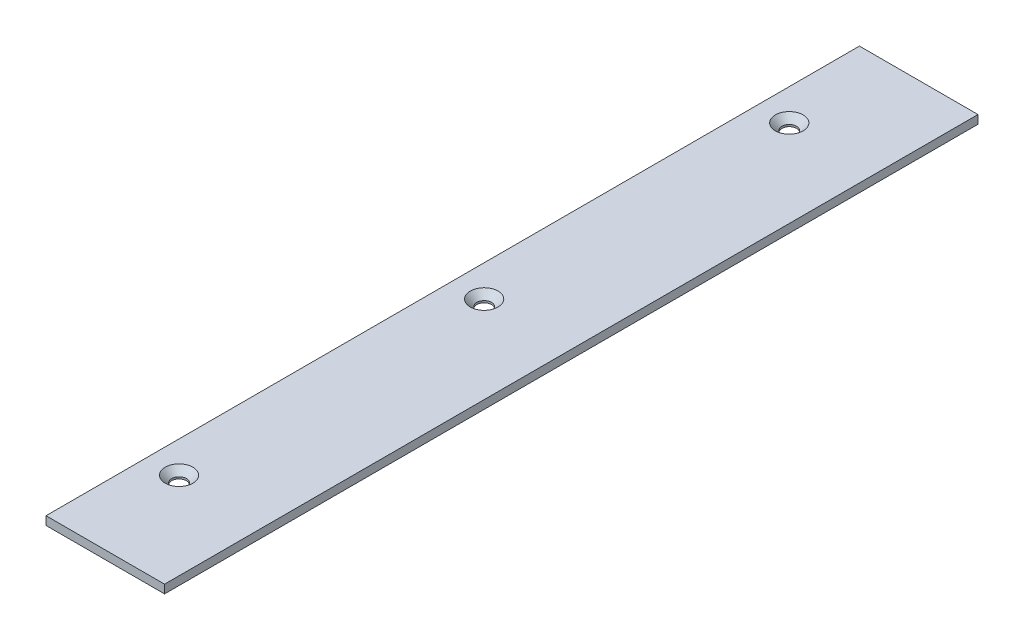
from build123d import *

# Parameters (mm, degrees)
BOSS_EXTRUDE1_DEPTH                            = 152.5
BOSS_EXTRUDE1_DEPTH_BACK                       = 152.5
SKETCH1_W                                      = 44.45
SKETCH1_H                                      = 3.175
CSK_FOR_M5_FLAT_HEAD_MACHINE_SCREW1_AT_2_COUNT = 2
CSK_FOR_M5_FLAT_HEAD_MACHINE_SCREW1_AT_2_PITCH = 114.4
CSK_FOR_M5_FLAT_HEAD_MACHINE_SCREW1_AT_3_COUNT = 2
CSK_FOR_M5_FLAT_HEAD_MACHINE_SCREW1_AT_3_PITCH = 228.8


with BuildPart() as part:
    # Sketch1 → Boss-Extrude1 (new, two sides: drawn at the far end of the back side and taken through both)
    with BuildSketch(Plane.XY.offset(-BOSS_EXTRUDE1_DEPTH_BACK)):
        Rectangle(SKETCH1_W, SKETCH1_H)
    extrude(amount=BOSS_EXTRUDE1_DEPTH + BOSS_EXTRUDE1_DEPTH_BACK)

    # Sketch3 → CSK for M5 Flat Head Machine Screw1 (revolve, cut)
    with BuildSketch(Plane(origin=(-10.4394, 1.5875, 114.4), x_dir=(0, 0, 1), z_dir=(1, 0, 0))):
        Polygon((0, 0), (0, 3.175), (2.75, 3.175), (2.75, 2.45), (5.2, 0), align=None)
    csk_for_m5_flat_head_machine_screw1 = revolve(axis=Axis((-10.4394, 7.9375, 114.4), (0, -1, 0)), mode=Mode.SUBTRACT)

    # CSK for M5 Flat Head Machine Screw1 at 2: CSK for M5 Flat Head Machine Screw1 ×2
    with Locations(*[(0, 0, -i * CSK_FOR_M5_FLAT_HEAD_MACHINE_SCREW1_AT_2_PITCH) for i in range(1, CSK_FOR_M5_FLAT_HEAD_MACHINE_SCREW1_AT_2_COUNT)]):
        add(csk_for_m5_flat_head_machine_screw1, mode=Mode.SUBTRACT)

    # CSK for M5 Flat Head Machine Screw1 at 3: CSK for M5 Flat Head Machine Screw1 ×2
    with Locations(*[(0, 0, -i * CSK_FOR_M5_FLAT_HEAD_MACHINE_SCREW1_AT_3_PITCH) for i in range(1, CSK_FOR_M5_FLAT_HEAD_MACHINE_SCREW1_AT_3_COUNT)]):
        add(csk_for_m5_flat_head_machine_screw1, mode=Mode.SUBTRACT)


solid = part.part
